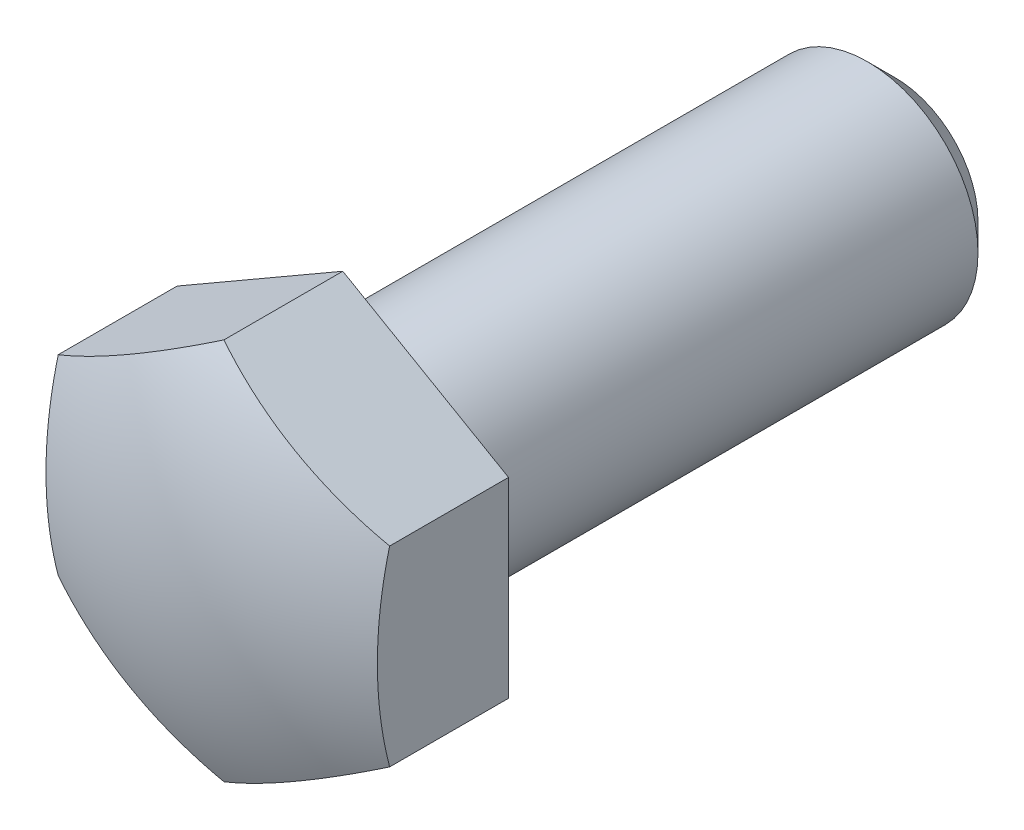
ISO-10303-21;
HEADER;
FILE_DESCRIPTION(('STEP AP214'),'2;1');
FILE_NAME('part.step','',(''),(''),'','','');
FILE_SCHEMA(('AUTOMOTIVE_DESIGN { 1 0 10303 214 1 1 1 1 }'));
ENDSEC;
DATA;
#1=APPLICATION_CONTEXT('core data for automotive mechanical design processes');
#2=APPLICATION_PROTOCOL_DEFINITION('international standard','automotive_design',2000,#1);
#3=PRODUCT_CONTEXT('',#1,'mechanical');
#4=PRODUCT('Part','Part','',(#3));
#5=PRODUCT_RELATED_PRODUCT_CATEGORY('part','',(#4));
#6=PRODUCT_DEFINITION_FORMATION('','',#4);
#7=PRODUCT_DEFINITION_CONTEXT('part definition',#1,'design');
#8=PRODUCT_DEFINITION('design','',#6,#7);
#9=PRODUCT_DEFINITION_SHAPE('','',#8);
#10=(LENGTH_UNIT() NAMED_UNIT(*) SI_UNIT(.MILLI.,.METRE.));
#11=(NAMED_UNIT(*) PLANE_ANGLE_UNIT() SI_UNIT($,.RADIAN.));
#12=(NAMED_UNIT(*) SI_UNIT($,.STERADIAN.) SOLID_ANGLE_UNIT());
#13=UNCERTAINTY_MEASURE_WITH_UNIT(LENGTH_MEASURE(1.E-05),#10,'distance_accuracy_value','');
#14=(GEOMETRIC_REPRESENTATION_CONTEXT(3) GLOBAL_UNCERTAINTY_ASSIGNED_CONTEXT((#13)) GLOBAL_UNIT_ASSIGNED_CONTEXT((#10,
#11,#12)) REPRESENTATION_CONTEXT('',''));
#15=CARTESIAN_POINT('',(0.,0.,0.));
#16=DIRECTION('',(0.,0.,1.));
#17=DIRECTION('',(1.,0.,0.));
#18=AXIS2_PLACEMENT_3D('',#15,#16,#17);
#19=CARTESIAN_POINT('',(12.,0.,0.));
#20=DIRECTION('',(0.,0.,1.));
#21=DIRECTION('',(1.,0.,0.));
#22=AXIS2_PLACEMENT_3D('',#19,#20,#21);
#23=PLANE('',#22);
#24=CARTESIAN_POINT('',(0.,0.,0.));
#25=DIRECTION('',(0.,0.,1.));
#26=DIRECTION('',(1.,0.,0.));
#27=AXIS2_PLACEMENT_3D('',#24,#25,#26);
#28=CIRCLE('',#27,12.);
#29=CARTESIAN_POINT('',(12.,0.,0.));
#30=VERTEX_POINT('',#29);
#31=EDGE_CURVE('E110',#30,#30,#28,.T.);
#32=ORIENTED_EDGE('',*,*,#31,.T.);
#33=EDGE_LOOP('',(#32));
#34=FACE_BOUND('',#33,.T.);
#35=DIRECTION('',(-0.86602540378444,-0.5,0.));
#36=VECTOR('',#35,1.);
#37=CARTESIAN_POINT('',(18.,-10.3923048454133,0.));
#38=LINE('',#37,#36);
#39=CARTESIAN_POINT('',(18.,-10.3923048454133,0.));
#40=VERTEX_POINT('',#39);
#41=CARTESIAN_POINT('',(0.,-20.7846096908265,0.));
#42=VERTEX_POINT('',#41);
#43=EDGE_CURVE('E107',#40,#42,#38,.T.);
#44=ORIENTED_EDGE('',*,*,#43,.T.);
#45=DIRECTION('',(0.86602540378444,-0.5,0.));
#46=VECTOR('',#45,1.);
#47=CARTESIAN_POINT('',(-18.,-10.3923048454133,0.));
#48=LINE('',#47,#46);
#49=CARTESIAN_POINT('',(-18.,-10.3923048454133,0.));
#50=VERTEX_POINT('',#49);
#51=EDGE_CURVE('E85',#50,#42,#48,.T.);
#52=ORIENTED_EDGE('',*,*,#51,.F.);
#53=DIRECTION('',(0.,-1.,0.));
#54=VECTOR('',#53,1.);
#55=CARTESIAN_POINT('',(-18.,10.3923048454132,0.));
#56=LINE('',#55,#54);
#57=CARTESIAN_POINT('',(-18.,10.3923048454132,0.));
#58=VERTEX_POINT('',#57);
#59=EDGE_CURVE('E62',#58,#50,#56,.T.);
#60=ORIENTED_EDGE('',*,*,#59,.F.);
#61=DIRECTION('',(0.866025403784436,0.5,0.));
#62=VECTOR('',#61,1.);
#63=CARTESIAN_POINT('',(-18.,10.3923048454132,0.));
#64=LINE('',#63,#62);
#65=CARTESIAN_POINT('',(0.,20.7846096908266,0.));
#66=VERTEX_POINT('',#65);
#67=EDGE_CURVE('E109',#58,#66,#64,.T.);
#68=ORIENTED_EDGE('',*,*,#67,.T.);
#69=DIRECTION('',(-0.866025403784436,0.5,0.));
#70=VECTOR('',#69,1.);
#71=CARTESIAN_POINT('',(18.,10.3923048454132,0.));
#72=LINE('',#71,#70);
#73=CARTESIAN_POINT('',(18.,10.3923048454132,0.));
#74=VERTEX_POINT('',#73);
#75=EDGE_CURVE('E100',#74,#66,#72,.T.);
#76=ORIENTED_EDGE('',*,*,#75,.F.);
#77=DIRECTION('',(0.,-1.,0.));
#78=VECTOR('',#77,1.);
#79=CARTESIAN_POINT('',(18.,10.3923048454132,0.));
#80=LINE('',#79,#78);
#81=EDGE_CURVE('E82',#74,#40,#80,.T.);
#82=ORIENTED_EDGE('',*,*,#81,.T.);
#83=EDGE_LOOP('',(#44,#52,#60,#68,#76,#82));
#84=FACE_BOUND('',#83,.T.);
#85=ADVANCED_FACE('F14',(#34,#84),#23,.F.);
#86=CARTESIAN_POINT('',(0.,0.,0.));
#87=DIRECTION('',(0.,0.,1.));
#88=DIRECTION('',(1.,0.,0.));
#89=AXIS2_PLACEMENT_3D('',#86,#87,#88);
#90=CYLINDRICAL_SURFACE('',#89,12.);
#91=CARTESIAN_POINT('',(0.,0.,-57.));
#92=DIRECTION('',(0.,0.,1.));
#93=DIRECTION('',(1.,0.,0.));
#94=AXIS2_PLACEMENT_3D('',#91,#92,#93);
#95=CIRCLE('',#94,12.);
#96=CARTESIAN_POINT('',(12.,0.,-57.));
#97=VERTEX_POINT('',#96);
#98=EDGE_CURVE('E23',#97,#97,#95,.T.);
#99=ORIENTED_EDGE('',*,*,#98,.T.);
#100=EDGE_LOOP('',(#99));
#101=FACE_BOUND('',#100,.T.);
#102=ORIENTED_EDGE('',*,*,#31,.F.);
#103=EDGE_LOOP('',(#102));
#104=FACE_BOUND('',#103,.T.);
#105=ADVANCED_FACE('F146',(#101,#104),#90,.T.);
#106=CARTESIAN_POINT('',(0.,0.,-60.));
#107=DIRECTION('',(0.,0.,1.));
#108=DIRECTION('',(1.,0.,0.));
#109=AXIS2_PLACEMENT_3D('',#106,#107,#108);
#110=PLANE('',#109);
#111=CARTESIAN_POINT('',(0.,0.,-60.));
#112=DIRECTION('',(0.,0.,1.));
#113=DIRECTION('',(1.,0.,0.));
#114=AXIS2_PLACEMENT_3D('',#111,#112,#113);
#115=CIRCLE('',#114,9.);
#116=CARTESIAN_POINT('',(9.,0.,-60.));
#117=VERTEX_POINT('',#116);
#118=EDGE_CURVE('E9',#117,#117,#115,.F.);
#119=ORIENTED_EDGE('',*,*,#118,.T.);
#120=EDGE_LOOP('',(#119));
#121=FACE_BOUND('',#120,.T.);
#122=ADVANCED_FACE('F152',(#121),#110,.F.);
#123=CARTESIAN_POINT('',(-18.,-10.3923048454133,18.));
#124=DIRECTION('',(0.5,0.86602540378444,0.));
#125=DIRECTION('',(-0.86602540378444,0.5,0.));
#126=AXIS2_PLACEMENT_3D('',#123,#124,#125);
#127=PLANE('',#126);
#128=CARTESIAN_POINT('',(-9.,-15.5884572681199,-27.));
#129=DIRECTION('',(0.5,0.86602540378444,0.));
#130=DIRECTION('',(-0.86602540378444,0.5,0.));
#131=AXIS2_PLACEMENT_3D('',#128,#129,#130);
#132=CIRCLE('',#131,41.2431812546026);
#133=CARTESIAN_POINT('',(0.,-20.7846096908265,12.9124040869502));
#134=VERTEX_POINT('',#133);
#135=CARTESIAN_POINT('',(-18.,-10.3923048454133,12.9124040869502));
#136=VERTEX_POINT('',#135);
#137=EDGE_CURVE('E76',#134,#136,#132,.F.);
#138=ORIENTED_EDGE('',*,*,#137,.T.);
#139=DIRECTION('',(0.,0.,-1.));
#140=VECTOR('',#139,1.);
#141=CARTESIAN_POINT('',(-18.,-10.3923048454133,18.));
#142=LINE('',#141,#140);
#143=EDGE_CURVE('E78',#136,#50,#142,.T.);
#144=ORIENTED_EDGE('',*,*,#143,.T.);
#145=ORIENTED_EDGE('',*,*,#51,.T.);
#146=DIRECTION('',(0.,0.,-1.));
#147=VECTOR('',#146,1.);
#148=CARTESIAN_POINT('',(0.,-20.7846096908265,18.));
#149=LINE('',#148,#147);
#150=EDGE_CURVE('E31',#134,#42,#149,.T.);
#151=ORIENTED_EDGE('',*,*,#150,.F.);
#152=EDGE_LOOP('',(#138,#144,#145,#151));
#153=FACE_BOUND('',#152,.T.);
#154=ADVANCED_FACE('F77',(#153),#127,.F.);
#155=CARTESIAN_POINT('',(-18.,10.3923048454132,18.));
#156=DIRECTION('',(1.,0.,0.));
#157=DIRECTION('',(0.,1.,0.));
#158=AXIS2_PLACEMENT_3D('',#155,#156,#157);
#159=PLANE('',#158);
#160=CARTESIAN_POINT('',(-18.,0.,-27.));
#161=DIRECTION('',(1.,0.,0.));
#162=DIRECTION('',(0.,1.,0.));
#163=AXIS2_PLACEMENT_3D('',#160,#161,#162);
#164=CIRCLE('',#163,41.2431812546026);
#165=CARTESIAN_POINT('',(-18.,10.3923048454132,12.9124040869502));
#166=VERTEX_POINT('',#165);
#167=EDGE_CURVE('E71',#136,#166,#164,.F.);
#168=ORIENTED_EDGE('',*,*,#167,.T.);
#169=DIRECTION('',(0.,0.,-1.));
#170=VECTOR('',#169,1.);
#171=CARTESIAN_POINT('',(-18.,10.3923048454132,18.));
#172=LINE('',#171,#170);
#173=EDGE_CURVE('E91',#166,#58,#172,.T.);
#174=ORIENTED_EDGE('',*,*,#173,.T.);
#175=ORIENTED_EDGE('',*,*,#59,.T.);
#176=ORIENTED_EDGE('',*,*,#143,.F.);
#177=EDGE_LOOP('',(#168,#174,#175,#176));
#178=FACE_BOUND('',#177,.T.);
#179=ADVANCED_FACE('F84',(#178),#159,.F.);
#180=CARTESIAN_POINT('',(-18.,10.3923048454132,18.));
#181=DIRECTION('',(-0.5,0.866025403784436,0.));
#182=DIRECTION('',(-0.866025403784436,-0.5,0.));
#183=AXIS2_PLACEMENT_3D('',#180,#181,#182);
#184=PLANE('',#183);
#185=DIRECTION('',(0.,0.,-1.));
#186=VECTOR('',#185,1.);
#187=CARTESIAN_POINT('',(0.,20.7846096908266,18.));
#188=LINE('',#187,#186);
#189=CARTESIAN_POINT('',(0.,20.7846096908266,12.9124040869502));
#190=VERTEX_POINT('',#189);
#191=EDGE_CURVE('E53',#190,#66,#188,.T.);
#192=ORIENTED_EDGE('',*,*,#191,.T.);
#193=ORIENTED_EDGE('',*,*,#67,.F.);
#194=ORIENTED_EDGE('',*,*,#173,.F.);
#195=CARTESIAN_POINT('',(-9.,15.5884572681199,-27.));
#196=DIRECTION('',(-0.5,0.866025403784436,0.));
#197=DIRECTION('',(-0.866025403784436,-0.5,0.));
#198=AXIS2_PLACEMENT_3D('',#195,#196,#197);
#199=CIRCLE('',#198,41.2431812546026);
#200=EDGE_CURVE('E90',#190,#166,#199,.F.);
#201=ORIENTED_EDGE('',*,*,#200,.F.);
#202=EDGE_LOOP('',(#192,#193,#194,#201));
#203=FACE_BOUND('',#202,.T.);
#204=ADVANCED_FACE('F134',(#203),#184,.T.);
#205=CARTESIAN_POINT('',(18.,10.3923048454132,18.));
#206=DIRECTION('',(-0.5,-0.866025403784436,0.));
#207=DIRECTION('',(0.866025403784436,-0.5,0.));
#208=AXIS2_PLACEMENT_3D('',#205,#206,#207);
#209=PLANE('',#208);
#210=CARTESIAN_POINT('',(9.,15.5884572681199,-27.));
#211=DIRECTION('',(-0.5,-0.866025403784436,0.));
#212=DIRECTION('',(0.866025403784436,-0.5,0.));
#213=AXIS2_PLACEMENT_3D('',#210,#211,#212);
#214=CIRCLE('',#213,41.2431812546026);
#215=CARTESIAN_POINT('',(18.,10.3923048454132,12.9124040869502));
#216=VERTEX_POINT('',#215);
#217=EDGE_CURVE('E103',#190,#216,#214,.F.);
#218=ORIENTED_EDGE('',*,*,#217,.T.);
#219=DIRECTION('',(0.,0.,-1.));
#220=VECTOR('',#219,1.);
#221=CARTESIAN_POINT('',(18.,10.3923048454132,18.));
#222=LINE('',#221,#220);
#223=EDGE_CURVE('E101',#216,#74,#222,.T.);
#224=ORIENTED_EDGE('',*,*,#223,.T.);
#225=ORIENTED_EDGE('',*,*,#75,.T.);
#226=ORIENTED_EDGE('',*,*,#191,.F.);
#227=EDGE_LOOP('',(#218,#224,#225,#226));
#228=FACE_BOUND('',#227,.T.);
#229=ADVANCED_FACE('F127',(#228),#209,.F.);
#230=CARTESIAN_POINT('',(18.,10.3923048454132,18.));
#231=DIRECTION('',(1.,0.,0.));
#232=DIRECTION('',(0.,1.,0.));
#233=AXIS2_PLACEMENT_3D('',#230,#231,#232);
#234=PLANE('',#233);
#235=DIRECTION('',(0.,0.,-1.));
#236=VECTOR('',#235,1.);
#237=CARTESIAN_POINT('',(18.,-10.3923048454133,18.));
#238=LINE('',#237,#236);
#239=CARTESIAN_POINT('',(18.,-10.3923048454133,12.9124040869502));
#240=VERTEX_POINT('',#239);
#241=EDGE_CURVE('E98',#240,#40,#238,.T.);
#242=ORIENTED_EDGE('',*,*,#241,.T.);
#243=ORIENTED_EDGE('',*,*,#81,.F.);
#244=ORIENTED_EDGE('',*,*,#223,.F.);
#245=CARTESIAN_POINT('',(18.,0.,-27.));
#246=DIRECTION('',(1.,0.,0.));
#247=DIRECTION('',(0.,1.,0.));
#248=AXIS2_PLACEMENT_3D('',#245,#246,#247);
#249=CIRCLE('',#248,41.2431812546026);
#250=EDGE_CURVE('E120',#240,#216,#249,.F.);
#251=ORIENTED_EDGE('',*,*,#250,.F.);
#252=EDGE_LOOP('',(#242,#243,#244,#251));
#253=FACE_BOUND('',#252,.T.);
#254=ADVANCED_FACE('F130',(#253),#234,.T.);
#255=CARTESIAN_POINT('',(18.,-10.3923048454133,18.));
#256=DIRECTION('',(0.5,-0.86602540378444,0.));
#257=DIRECTION('',(0.86602540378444,0.5,0.));
#258=AXIS2_PLACEMENT_3D('',#255,#256,#257);
#259=PLANE('',#258);
#260=ORIENTED_EDGE('',*,*,#150,.T.);
#261=ORIENTED_EDGE('',*,*,#43,.F.);
#262=ORIENTED_EDGE('',*,*,#241,.F.);
#263=CARTESIAN_POINT('',(9.,-15.5884572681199,-27.));
#264=DIRECTION('',(0.5,-0.86602540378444,0.));
#265=DIRECTION('',(0.86602540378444,0.5,0.));
#266=AXIS2_PLACEMENT_3D('',#263,#264,#265);
#267=CIRCLE('',#266,41.2431812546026);
#268=EDGE_CURVE('E106',#134,#240,#267,.F.);
#269=ORIENTED_EDGE('',*,*,#268,.F.);
#270=EDGE_LOOP('',(#260,#261,#262,#269));
#271=FACE_BOUND('',#270,.T.);
#272=ADVANCED_FACE('F158',(#271),#259,.T.);
#273=CARTESIAN_POINT('',(0.,0.,-27.));
#274=DIRECTION('',(0.,0.,1.));
#275=DIRECTION('',(1.,0.,0.));
#276=AXIS2_PLACEMENT_3D('',#273,#274,#275);
#277=SPHERICAL_SURFACE('',#276,45.);
#278=ORIENTED_EDGE('',*,*,#137,.F.);
#279=ORIENTED_EDGE('',*,*,#268,.T.);
#280=ORIENTED_EDGE('',*,*,#250,.T.);
#281=ORIENTED_EDGE('',*,*,#217,.F.);
#282=ORIENTED_EDGE('',*,*,#200,.T.);
#283=ORIENTED_EDGE('',*,*,#167,.F.);
#284=EDGE_LOOP('',(#278,#279,#280,#281,#282,#283));
#285=FACE_BOUND('',#284,.T.);
#286=ADVANCED_FACE('F88',(#285),#277,.T.);
#287=CARTESIAN_POINT('',(0.,0.,-57.));
#288=DIRECTION('',(0.,0.,1.));
#289=DIRECTION('',(1.,0.,0.));
#290=AXIS2_PLACEMENT_3D('',#287,#288,#289);
#291=CONICAL_SURFACE('',#290,12.,0.78539816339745);
#292=ORIENTED_EDGE('',*,*,#118,.F.);
#293=EDGE_LOOP('',(#292));
#294=FACE_BOUND('',#293,.T.);
#295=ORIENTED_EDGE('',*,*,#98,.F.);
#296=EDGE_LOOP('',(#295));
#297=FACE_BOUND('',#296,.T.);
#298=ADVANCED_FACE('F16',(#294,#297),#291,.T.);
#299=CLOSED_SHELL('',(#85,#105,#122,#154,#179,#204,#229,#254,#272,#286,#298));
#300=MANIFOLD_SOLID_BREP('B1',#299);
#301=ADVANCED_BREP_SHAPE_REPRESENTATION('',(#18,#300),#14);
#302=SHAPE_DEFINITION_REPRESENTATION(#9,#301);
ENDSEC;
END-ISO-10303-21;
